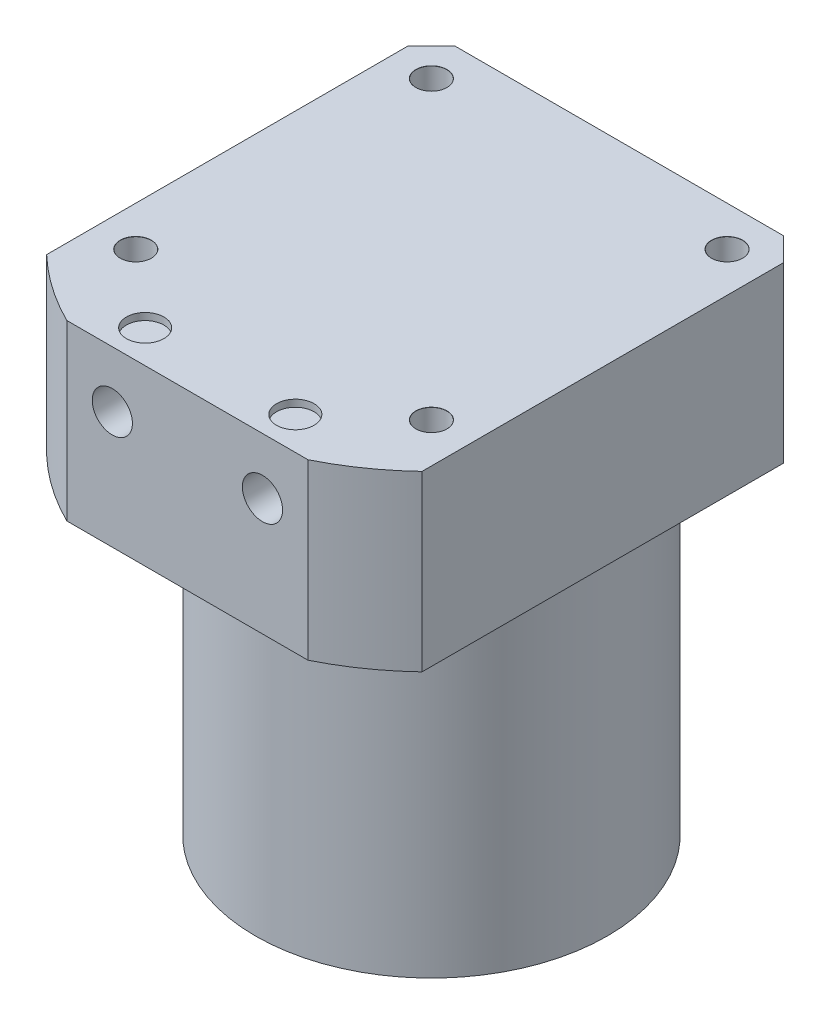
ISO-10303-21;
HEADER;
FILE_DESCRIPTION(('STEP AP214'),'2;1');
FILE_NAME('part.step','',(''),(''),'','','');
FILE_SCHEMA(('AUTOMOTIVE_DESIGN { 1 0 10303 214 1 1 1 1 }'));
ENDSEC;
DATA;
#1=APPLICATION_CONTEXT('core data for automotive mechanical design processes');
#2=APPLICATION_PROTOCOL_DEFINITION('international standard','automotive_design',2000,#1);
#3=PRODUCT_CONTEXT('',#1,'mechanical');
#4=PRODUCT('Part','Part','',(#3));
#5=PRODUCT_RELATED_PRODUCT_CATEGORY('part','',(#4));
#6=PRODUCT_DEFINITION_FORMATION('','',#4);
#7=PRODUCT_DEFINITION_CONTEXT('part definition',#1,'design');
#8=PRODUCT_DEFINITION('design','',#6,#7);
#9=PRODUCT_DEFINITION_SHAPE('','',#8);
#10=(LENGTH_UNIT() NAMED_UNIT(*) SI_UNIT(.MILLI.,.METRE.));
#11=(NAMED_UNIT(*) PLANE_ANGLE_UNIT() SI_UNIT($,.RADIAN.));
#12=(NAMED_UNIT(*) SI_UNIT($,.STERADIAN.) SOLID_ANGLE_UNIT());
#13=UNCERTAINTY_MEASURE_WITH_UNIT(LENGTH_MEASURE(1.E-05),#10,'distance_accuracy_value','');
#14=(GEOMETRIC_REPRESENTATION_CONTEXT(3) GLOBAL_UNCERTAINTY_ASSIGNED_CONTEXT((#13)) GLOBAL_UNIT_ASSIGNED_CONTEXT((#10,
#11,#12)) REPRESENTATION_CONTEXT('',''));
#15=CARTESIAN_POINT('',(0.,0.,0.));
#16=DIRECTION('',(0.,0.,1.));
#17=DIRECTION('',(1.,0.,0.));
#18=AXIS2_PLACEMENT_3D('',#15,#16,#17);
#19=CARTESIAN_POINT('',(-37.5,71.,0.));
#20=DIRECTION('',(0.,-1.,0.));
#21=DIRECTION('',(0.,0.,-1.));
#22=AXIS2_PLACEMENT_3D('',#19,#20,#21);
#23=PLANE('',#22);
#24=CARTESIAN_POINT('',(-31.5,71.,-31.5));
#25=DIRECTION('',(0.,-1.,0.));
#26=DIRECTION('',(0.,0.,-1.));
#27=AXIS2_PLACEMENT_3D('',#24,#25,#26);
#28=CIRCLE('',#27,5.5);
#29=CARTESIAN_POINT('',(-31.5,71.,-37.));
#30=VERTEX_POINT('',#29);
#31=EDGE_CURVE('E336',#30,#30,#28,.T.);
#32=ORIENTED_EDGE('',*,*,#31,.F.);
#33=EDGE_LOOP('',(#32));
#34=FACE_BOUND('',#33,.T.);
#35=CARTESIAN_POINT('',(31.5,71.,-31.5));
#36=DIRECTION('',(0.,-1.,0.));
#37=DIRECTION('',(0.,0.,-1.));
#38=AXIS2_PLACEMENT_3D('',#35,#36,#37);
#39=CIRCLE('',#38,5.5);
#40=CARTESIAN_POINT('',(31.5,71.,-37.));
#41=VERTEX_POINT('',#40);
#42=EDGE_CURVE('E351',#41,#41,#39,.T.);
#43=ORIENTED_EDGE('',*,*,#42,.F.);
#44=EDGE_LOOP('',(#43));
#45=FACE_BOUND('',#44,.T.);
#46=CARTESIAN_POINT('',(31.5,71.,31.5));
#47=DIRECTION('',(0.,-1.,0.));
#48=DIRECTION('',(0.,0.,-1.));
#49=AXIS2_PLACEMENT_3D('',#46,#47,#48);
#50=CIRCLE('',#49,5.5);
#51=CARTESIAN_POINT('',(31.5,71.,26.));
#52=VERTEX_POINT('',#51);
#53=EDGE_CURVE('E366',#52,#52,#50,.T.);
#54=ORIENTED_EDGE('',*,*,#53,.F.);
#55=EDGE_LOOP('',(#54));
#56=FACE_BOUND('',#55,.T.);
#57=CARTESIAN_POINT('',(-31.5,71.,31.5));
#58=DIRECTION('',(0.,-1.,0.));
#59=DIRECTION('',(0.,0.,-1.));
#60=AXIS2_PLACEMENT_3D('',#57,#58,#59);
#61=CIRCLE('',#60,5.5);
#62=CARTESIAN_POINT('',(-31.5,71.,26.));
#63=VERTEX_POINT('',#62);
#64=EDGE_CURVE('E381',#63,#63,#61,.T.);
#65=ORIENTED_EDGE('',*,*,#64,.F.);
#66=EDGE_LOOP('',(#65));
#67=FACE_BOUND('',#66,.T.);
#68=CARTESIAN_POINT('',(0.,71.,0.));
#69=DIRECTION('',(0.,1.,0.));
#70=DIRECTION('',(0.,0.,1.));
#71=AXIS2_PLACEMENT_3D('',#68,#69,#70);
#72=CIRCLE('',#71,37.5);
#73=CARTESIAN_POINT('',(0.,71.,37.5));
#74=VERTEX_POINT('',#73);
#75=EDGE_CURVE('E133',#74,#74,#72,.T.);
#76=ORIENTED_EDGE('',*,*,#75,.T.);
#77=EDGE_LOOP('',(#76));
#78=FACE_BOUND('',#77,.T.);
#79=DIRECTION('',(1.,0.,0.));
#80=VECTOR('',#79,1.);
#81=CARTESIAN_POINT('',(-37.5,71.,-40.));
#82=LINE('',#81,#80);
#83=CARTESIAN_POINT('',(-35.,71.,-40.));
#84=VERTEX_POINT('',#83);
#85=CARTESIAN_POINT('',(35.,71.,-40.));
#86=VERTEX_POINT('',#85);
#87=EDGE_CURVE('E107',#84,#86,#82,.T.);
#88=ORIENTED_EDGE('',*,*,#87,.T.);
#89=DIRECTION('',(-0.70710678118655,0.,-0.707106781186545));
#90=VECTOR('',#89,1.);
#91=CARTESIAN_POINT('',(18.7499999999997,71.,-56.2500000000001));
#92=LINE('',#91,#90);
#93=CARTESIAN_POINT('',(40.,71.,-35.));
#94=VERTEX_POINT('',#93);
#95=EDGE_CURVE('E41',#86,#94,#92,.F.);
#96=ORIENTED_EDGE('',*,*,#95,.T.);
#97=DIRECTION('',(0.,0.,1.));
#98=VECTOR('',#97,1.);
#99=CARTESIAN_POINT('',(40.,71.,0.));
#100=LINE('',#99,#98);
#101=CARTESIAN_POINT('',(40.,71.,42.));
#102=VERTEX_POINT('',#101);
#103=EDGE_CURVE('E122',#94,#102,#100,.T.);
#104=ORIENTED_EDGE('',*,*,#103,.T.);
#105=CARTESIAN_POINT('',(0.,71.,0.));
#106=DIRECTION('',(0.,1.,0.));
#107=DIRECTION('',(0.,0.,1.));
#108=AXIS2_PLACEMENT_3D('',#105,#106,#107);
#109=CIRCLE('',#108,58.);
#110=CARTESIAN_POINT('',(25.6904651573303,71.,52.));
#111=VERTEX_POINT('',#110);
#112=EDGE_CURVE('E130',#111,#102,#109,.T.);
#113=ORIENTED_EDGE('',*,*,#112,.F.);
#114=DIRECTION('',(-1.,0.,0.));
#115=VECTOR('',#114,1.);
#116=CARTESIAN_POINT('',(-37.5,71.,52.));
#117=LINE('',#116,#115);
#118=CARTESIAN_POINT('',(-25.6904651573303,71.,52.));
#119=VERTEX_POINT('',#118);
#120=EDGE_CURVE('E177',#111,#119,#117,.T.);
#121=ORIENTED_EDGE('',*,*,#120,.T.);
#122=CARTESIAN_POINT('',(-40.,71.,42.));
#123=VERTEX_POINT('',#122);
#124=EDGE_CURVE('E125',#123,#119,#109,.T.);
#125=ORIENTED_EDGE('',*,*,#124,.F.);
#126=DIRECTION('',(0.,0.,-1.));
#127=VECTOR('',#126,1.);
#128=CARTESIAN_POINT('',(-40.,71.,0.));
#129=LINE('',#128,#127);
#130=CARTESIAN_POINT('',(-40.,71.,-35.));
#131=VERTEX_POINT('',#130);
#132=EDGE_CURVE('E113',#123,#131,#129,.T.);
#133=ORIENTED_EDGE('',*,*,#132,.T.);
#134=DIRECTION('',(-0.707106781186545,0.,0.70710678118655));
#135=VECTOR('',#134,1.);
#136=CARTESIAN_POINT('',(-56.25,71.,-18.7499999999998));
#137=LINE('',#136,#135);
#138=EDGE_CURVE('E153',#131,#84,#137,.F.);
#139=ORIENTED_EDGE('',*,*,#138,.T.);
#140=EDGE_LOOP('',(#88,#96,#104,#113,#121,#125,#133,#139));
#141=FACE_BOUND('',#140,.T.);
#142=ADVANCED_FACE('F33',(#34,#45,#56,#67,#78,#141),#23,.T.);
#143=CARTESIAN_POINT('',(0.,87.0508296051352,0.));
#144=DIRECTION('',(0.,1.,0.));
#145=DIRECTION('',(0.,0.,1.));
#146=AXIS2_PLACEMENT_3D('',#143,#144,#145);
#147=CYLINDRICAL_SURFACE('',#146,58.);
#148=ORIENTED_EDGE('',*,*,#112,.T.);
#149=DIRECTION('',(0.,1.,0.));
#150=VECTOR('',#149,1.);
#151=CARTESIAN_POINT('',(40.,87.0508296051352,42.));
#152=LINE('',#151,#150);
#153=CARTESIAN_POINT('',(40.,108.,42.));
#154=VERTEX_POINT('',#153);
#155=EDGE_CURVE('E126',#102,#154,#152,.T.);
#156=ORIENTED_EDGE('',*,*,#155,.T.);
#157=CARTESIAN_POINT('',(0.,108.,0.));
#158=DIRECTION('',(0.,1.,0.));
#159=DIRECTION('',(0.,0.,1.));
#160=AXIS2_PLACEMENT_3D('',#157,#158,#159);
#161=CIRCLE('',#160,58.);
#162=CARTESIAN_POINT('',(25.6904651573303,108.,52.));
#163=VERTEX_POINT('',#162);
#164=EDGE_CURVE('E121',#163,#154,#161,.T.);
#165=ORIENTED_EDGE('',*,*,#164,.F.);
#166=DIRECTION('',(0.,1.,0.));
#167=VECTOR('',#166,1.);
#168=CARTESIAN_POINT('',(25.6904651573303,87.0508296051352,52.));
#169=LINE('',#168,#167);
#170=EDGE_CURVE('E180',#163,#111,#169,.F.);
#171=ORIENTED_EDGE('',*,*,#170,.T.);
#172=EDGE_LOOP('',(#148,#156,#165,#171));
#173=FACE_BOUND('',#172,.T.);
#174=ADVANCED_FACE('F184',(#173),#147,.T.);
#175=ORIENTED_EDGE('',*,*,#124,.T.);
#176=DIRECTION('',(0.,1.,0.));
#177=VECTOR('',#176,1.);
#178=CARTESIAN_POINT('',(-25.6904651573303,87.0508296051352,52.));
#179=LINE('',#178,#177);
#180=CARTESIAN_POINT('',(-25.6904651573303,108.,52.));
#181=VERTEX_POINT('',#180);
#182=EDGE_CURVE('E120',#119,#181,#179,.T.);
#183=ORIENTED_EDGE('',*,*,#182,.T.);
#184=CARTESIAN_POINT('',(-40.,108.,42.));
#185=VERTEX_POINT('',#184);
#186=EDGE_CURVE('E104',#185,#181,#161,.T.);
#187=ORIENTED_EDGE('',*,*,#186,.F.);
#188=DIRECTION('',(0.,1.,0.));
#189=VECTOR('',#188,1.);
#190=CARTESIAN_POINT('',(-40.,87.0508296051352,42.));
#191=LINE('',#190,#189);
#192=EDGE_CURVE('E111',#185,#123,#191,.F.);
#193=ORIENTED_EDGE('',*,*,#192,.T.);
#194=EDGE_LOOP('',(#175,#183,#187,#193));
#195=FACE_BOUND('',#194,.T.);
#196=ADVANCED_FACE('F119',(#195),#147,.T.);
#197=CARTESIAN_POINT('',(-58.,108.,0.));
#198=DIRECTION('',(0.,1.,0.));
#199=DIRECTION('',(0.,0.,1.));
#200=AXIS2_PLACEMENT_3D('',#197,#198,#199);
#201=PLANE('',#200);
#202=CARTESIAN_POINT('',(-31.5,108.,-31.5));
#203=DIRECTION('',(0.,-1.,0.));
#204=DIRECTION('',(0.,0.,-1.));
#205=AXIS2_PLACEMENT_3D('',#202,#203,#204);
#206=CIRCLE('',#205,3.32499999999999);
#207=CARTESIAN_POINT('',(-31.5,108.,-34.825));
#208=VERTEX_POINT('',#207);
#209=EDGE_CURVE('E337',#208,#208,#206,.T.);
#210=ORIENTED_EDGE('',*,*,#209,.T.);
#211=EDGE_LOOP('',(#210));
#212=FACE_BOUND('',#211,.T.);
#213=CARTESIAN_POINT('',(31.5,108.,-31.5));
#214=DIRECTION('',(0.,-1.,0.));
#215=DIRECTION('',(0.,0.,-1.));
#216=AXIS2_PLACEMENT_3D('',#213,#214,#215);
#217=CIRCLE('',#216,3.32499999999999);
#218=CARTESIAN_POINT('',(31.5,108.,-34.825));
#219=VERTEX_POINT('',#218);
#220=EDGE_CURVE('E348',#219,#219,#217,.T.);
#221=ORIENTED_EDGE('',*,*,#220,.T.);
#222=EDGE_LOOP('',(#221));
#223=FACE_BOUND('',#222,.T.);
#224=CARTESIAN_POINT('',(31.5,108.,31.5));
#225=DIRECTION('',(0.,-1.,0.));
#226=DIRECTION('',(0.,0.,-1.));
#227=AXIS2_PLACEMENT_3D('',#224,#225,#226);
#228=CIRCLE('',#227,3.32499999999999);
#229=CARTESIAN_POINT('',(31.5,108.,28.175));
#230=VERTEX_POINT('',#229);
#231=EDGE_CURVE('E363',#230,#230,#228,.T.);
#232=ORIENTED_EDGE('',*,*,#231,.T.);
#233=EDGE_LOOP('',(#232));
#234=FACE_BOUND('',#233,.T.);
#235=CARTESIAN_POINT('',(-31.5,108.,31.5));
#236=DIRECTION('',(0.,-1.,0.));
#237=DIRECTION('',(0.,0.,-1.));
#238=AXIS2_PLACEMENT_3D('',#235,#236,#237);
#239=CIRCLE('',#238,3.32499999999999);
#240=CARTESIAN_POINT('',(-31.5,108.,28.175));
#241=VERTEX_POINT('',#240);
#242=EDGE_CURVE('E378',#241,#241,#239,.T.);
#243=ORIENTED_EDGE('',*,*,#242,.T.);
#244=EDGE_LOOP('',(#243));
#245=FACE_BOUND('',#244,.T.);
#246=CARTESIAN_POINT('',(-16.,108.,45.));
#247=DIRECTION('',(0.,1.,0.));
#248=DIRECTION('',(0.,0.,1.));
#249=AXIS2_PLACEMENT_3D('',#246,#247,#248);
#250=CIRCLE('',#249,4.);
#251=CARTESIAN_POINT('',(-16.,108.,49.));
#252=VERTEX_POINT('',#251);
#253=EDGE_CURVE('E405',#252,#252,#250,.T.);
#254=ORIENTED_EDGE('',*,*,#253,.F.);
#255=EDGE_LOOP('',(#254));
#256=FACE_BOUND('',#255,.T.);
#257=CARTESIAN_POINT('',(16.,108.,45.));
#258=DIRECTION('',(0.,1.,0.));
#259=DIRECTION('',(0.,0.,1.));
#260=AXIS2_PLACEMENT_3D('',#257,#258,#259);
#261=CIRCLE('',#260,4.);
#262=CARTESIAN_POINT('',(16.,108.,49.));
#263=VERTEX_POINT('',#262);
#264=EDGE_CURVE('E170',#263,#263,#261,.T.);
#265=ORIENTED_EDGE('',*,*,#264,.F.);
#266=EDGE_LOOP('',(#265));
#267=FACE_BOUND('',#266,.T.);
#268=DIRECTION('',(0.,0.,-1.));
#269=VECTOR('',#268,1.);
#270=CARTESIAN_POINT('',(40.,108.,0.));
#271=LINE('',#270,#269);
#272=CARTESIAN_POINT('',(40.,108.,-35.));
#273=VERTEX_POINT('',#272);
#274=EDGE_CURVE('E139',#154,#273,#271,.T.);
#275=ORIENTED_EDGE('',*,*,#274,.T.);
#276=DIRECTION('',(0.70710678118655,0.,0.707106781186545));
#277=VECTOR('',#276,1.);
#278=CARTESIAN_POINT('',(8.4999999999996,108.,-66.5000000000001));
#279=LINE('',#278,#277);
#280=CARTESIAN_POINT('',(35.,108.,-40.));
#281=VERTEX_POINT('',#280);
#282=EDGE_CURVE('E147',#273,#281,#279,.F.);
#283=ORIENTED_EDGE('',*,*,#282,.T.);
#284=DIRECTION('',(-1.,0.,0.));
#285=VECTOR('',#284,1.);
#286=CARTESIAN_POINT('',(-40.,108.,-40.));
#287=LINE('',#286,#285);
#288=CARTESIAN_POINT('',(-35.,108.,-40.));
#289=VERTEX_POINT('',#288);
#290=EDGE_CURVE('E108',#281,#289,#287,.T.);
#291=ORIENTED_EDGE('',*,*,#290,.T.);
#292=DIRECTION('',(0.707106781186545,0.,-0.70710678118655));
#293=VECTOR('',#292,1.);
#294=CARTESIAN_POINT('',(-66.4999999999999,108.,-8.49999999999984));
#295=LINE('',#294,#293);
#296=CARTESIAN_POINT('',(-40.,108.,-35.));
#297=VERTEX_POINT('',#296);
#298=EDGE_CURVE('E106',#289,#297,#295,.F.);
#299=ORIENTED_EDGE('',*,*,#298,.T.);
#300=DIRECTION('',(0.,0.,1.));
#301=VECTOR('',#300,1.);
#302=CARTESIAN_POINT('',(-40.,108.,-40.));
#303=LINE('',#302,#301);
#304=EDGE_CURVE('E98',#297,#185,#303,.T.);
#305=ORIENTED_EDGE('',*,*,#304,.T.);
#306=ORIENTED_EDGE('',*,*,#186,.T.);
#307=DIRECTION('',(1.,0.,0.));
#308=VECTOR('',#307,1.);
#309=CARTESIAN_POINT('',(-58.,108.,52.));
#310=LINE('',#309,#308);
#311=EDGE_CURVE('E141',#181,#163,#310,.T.);
#312=ORIENTED_EDGE('',*,*,#311,.T.);
#313=ORIENTED_EDGE('',*,*,#164,.T.);
#314=EDGE_LOOP('',(#275,#283,#291,#299,#305,#306,#312,#313));
#315=FACE_BOUND('',#314,.T.);
#316=ADVANCED_FACE('F101',(#212,#223,#234,#245,#256,#267,#315),#201,.T.);
#317=CARTESIAN_POINT('',(0.,0.,0.));
#318=DIRECTION('',(0.,-1.,0.));
#319=DIRECTION('',(0.,0.,-1.));
#320=AXIS2_PLACEMENT_3D('',#317,#318,#319);
#321=PLANE('',#320);
#322=CARTESIAN_POINT('',(0.,0.,0.));
#323=DIRECTION('',(0.,1.,0.));
#324=DIRECTION('',(0.,0.,1.));
#325=AXIS2_PLACEMENT_3D('',#322,#323,#324);
#326=CIRCLE('',#325,37.5);
#327=CARTESIAN_POINT('',(0.,0.,37.5));
#328=VERTEX_POINT('',#327);
#329=EDGE_CURVE('E136',#328,#328,#326,.T.);
#330=ORIENTED_EDGE('',*,*,#329,.F.);
#331=EDGE_LOOP('',(#330));
#332=FACE_BOUND('',#331,.T.);
#333=ADVANCED_FACE('F212',(#332),#321,.T.);
#334=CARTESIAN_POINT('',(0.,87.0508296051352,0.));
#335=DIRECTION('',(0.,1.,0.));
#336=DIRECTION('',(0.,0.,1.));
#337=AXIS2_PLACEMENT_3D('',#334,#335,#336);
#338=CYLINDRICAL_SURFACE('',#337,37.5);
#339=ORIENTED_EDGE('',*,*,#329,.T.);
#340=EDGE_LOOP('',(#339));
#341=FACE_BOUND('',#340,.T.);
#342=ORIENTED_EDGE('',*,*,#75,.F.);
#343=EDGE_LOOP('',(#342));
#344=FACE_BOUND('',#343,.T.);
#345=ADVANCED_FACE('F209',(#341,#344),#338,.T.);
#346=CARTESIAN_POINT('',(-40.,0.,-40.));
#347=DIRECTION('',(0.,0.,-1.));
#348=DIRECTION('',(-1.,0.,0.));
#349=AXIS2_PLACEMENT_3D('',#346,#347,#348);
#350=PLANE('',#349);
#351=ORIENTED_EDGE('',*,*,#290,.F.);
#352=DIRECTION('',(0.,-1.,0.));
#353=VECTOR('',#352,1.);
#354=CARTESIAN_POINT('',(35.,0.,-40.));
#355=LINE('',#354,#353);
#356=EDGE_CURVE('E54',#281,#86,#355,.T.);
#357=ORIENTED_EDGE('',*,*,#356,.T.);
#358=ORIENTED_EDGE('',*,*,#87,.F.);
#359=DIRECTION('',(0.,1.,0.));
#360=VECTOR('',#359,1.);
#361=CARTESIAN_POINT('',(-35.,0.,-40.));
#362=LINE('',#361,#360);
#363=EDGE_CURVE('E149',#84,#289,#362,.T.);
#364=ORIENTED_EDGE('',*,*,#363,.T.);
#365=EDGE_LOOP('',(#351,#357,#358,#364));
#366=FACE_BOUND('',#365,.T.);
#367=ADVANCED_FACE('F165',(#366),#350,.T.);
#368=CARTESIAN_POINT('',(-40.,0.,-40.));
#369=DIRECTION('',(-1.,0.,0.));
#370=DIRECTION('',(0.,0.,1.));
#371=AXIS2_PLACEMENT_3D('',#368,#369,#370);
#372=PLANE('',#371);
#373=ORIENTED_EDGE('',*,*,#304,.F.);
#374=DIRECTION('',(0.,-1.,0.));
#375=VECTOR('',#374,1.);
#376=CARTESIAN_POINT('',(-40.,0.,-35.));
#377=LINE('',#376,#375);
#378=EDGE_CURVE('E12',#297,#131,#377,.T.);
#379=ORIENTED_EDGE('',*,*,#378,.T.);
#380=ORIENTED_EDGE('',*,*,#132,.F.);
#381=ORIENTED_EDGE('',*,*,#192,.F.);
#382=EDGE_LOOP('',(#373,#379,#380,#381));
#383=FACE_BOUND('',#382,.T.);
#384=ADVANCED_FACE('F112',(#383),#372,.T.);
#385=CARTESIAN_POINT('',(40.,0.,-40.));
#386=DIRECTION('',(1.,0.,0.));
#387=DIRECTION('',(0.,0.,-1.));
#388=AXIS2_PLACEMENT_3D('',#385,#386,#387);
#389=PLANE('',#388);
#390=ORIENTED_EDGE('',*,*,#103,.F.);
#391=DIRECTION('',(0.,1.,0.));
#392=VECTOR('',#391,1.);
#393=CARTESIAN_POINT('',(40.,0.,-35.));
#394=LINE('',#393,#392);
#395=EDGE_CURVE('E143',#94,#273,#394,.T.);
#396=ORIENTED_EDGE('',*,*,#395,.T.);
#397=ORIENTED_EDGE('',*,*,#274,.F.);
#398=ORIENTED_EDGE('',*,*,#155,.F.);
#399=EDGE_LOOP('',(#390,#396,#397,#398));
#400=FACE_BOUND('',#399,.T.);
#401=ADVANCED_FACE('F162',(#400),#389,.T.);
#402=CARTESIAN_POINT('',(-40.,0.,52.));
#403=DIRECTION('',(0.,0.,1.));
#404=DIRECTION('',(1.,0.,0.));
#405=AXIS2_PLACEMENT_3D('',#402,#403,#404);
#406=PLANE('',#405);
#407=CARTESIAN_POINT('',(-16.,96.,52.));
#408=DIRECTION('',(0.,0.,1.));
#409=DIRECTION('',(1.,0.,0.));
#410=AXIS2_PLACEMENT_3D('',#407,#408,#409);
#411=CIRCLE('',#410,4.283);
#412=CARTESIAN_POINT('',(-11.717,96.,52.));
#413=VERTEX_POINT('',#412);
#414=EDGE_CURVE('E393',#413,#413,#411,.T.);
#415=ORIENTED_EDGE('',*,*,#414,.F.);
#416=EDGE_LOOP('',(#415));
#417=FACE_BOUND('',#416,.T.);
#418=CARTESIAN_POINT('',(16.,96.,52.));
#419=DIRECTION('',(0.,0.,1.));
#420=DIRECTION('',(1.,0.,0.));
#421=AXIS2_PLACEMENT_3D('',#418,#419,#420);
#422=CIRCLE('',#421,4.283);
#423=CARTESIAN_POINT('',(20.283,96.,52.));
#424=VERTEX_POINT('',#423);
#425=EDGE_CURVE('E399',#424,#424,#422,.T.);
#426=ORIENTED_EDGE('',*,*,#425,.F.);
#427=EDGE_LOOP('',(#426));
#428=FACE_BOUND('',#427,.T.);
#429=ORIENTED_EDGE('',*,*,#311,.F.);
#430=ORIENTED_EDGE('',*,*,#182,.F.);
#431=ORIENTED_EDGE('',*,*,#120,.F.);
#432=ORIENTED_EDGE('',*,*,#170,.F.);
#433=EDGE_LOOP('',(#429,#430,#431,#432));
#434=FACE_BOUND('',#433,.T.);
#435=ADVANCED_FACE('F186',(#417,#428,#434),#406,.T.);
#436=CARTESIAN_POINT('',(40.,0.,-35.));
#437=DIRECTION('',(-0.707106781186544,0.,0.70710678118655));
#438=DIRECTION('',(0.70710678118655,0.,0.707106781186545));
#439=AXIS2_PLACEMENT_3D('',#436,#437,#438);
#440=PLANE('',#439);
#441=ORIENTED_EDGE('',*,*,#95,.F.);
#442=ORIENTED_EDGE('',*,*,#356,.F.);
#443=ORIENTED_EDGE('',*,*,#282,.F.);
#444=ORIENTED_EDGE('',*,*,#395,.F.);
#445=EDGE_LOOP('',(#441,#442,#443,#444));
#446=FACE_BOUND('',#445,.T.);
#447=ADVANCED_FACE('F164',(#446),#440,.F.);
#448=CARTESIAN_POINT('',(-35.,0.,-40.));
#449=DIRECTION('',(0.70710678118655,0.,0.707106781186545));
#450=DIRECTION('',(0.707106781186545,0.,-0.70710678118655));
#451=AXIS2_PLACEMENT_3D('',#448,#449,#450);
#452=PLANE('',#451);
#453=ORIENTED_EDGE('',*,*,#138,.F.);
#454=ORIENTED_EDGE('',*,*,#378,.F.);
#455=ORIENTED_EDGE('',*,*,#298,.F.);
#456=ORIENTED_EDGE('',*,*,#363,.F.);
#457=EDGE_LOOP('',(#453,#454,#455,#456));
#458=FACE_BOUND('',#457,.T.);
#459=ADVANCED_FACE('F35',(#458),#452,.F.);
#460=CARTESIAN_POINT('',(16.,106.5,45.));
#461=DIRECTION('',(0.,-1.,0.));
#462=DIRECTION('',(0.,0.,-1.));
#463=AXIS2_PLACEMENT_3D('',#460,#461,#462);
#464=PLANE('',#463);
#465=CARTESIAN_POINT('',(16.,106.5,45.));
#466=DIRECTION('',(0.,1.,0.));
#467=DIRECTION('',(0.,0.,1.));
#468=AXIS2_PLACEMENT_3D('',#465,#466,#467);
#469=CIRCLE('',#468,4.);
#470=CARTESIAN_POINT('',(16.,106.5,49.));
#471=VERTEX_POINT('',#470);
#472=EDGE_CURVE('E167',#471,#471,#469,.T.);
#473=ORIENTED_EDGE('',*,*,#472,.T.);
#474=EDGE_LOOP('',(#473));
#475=FACE_BOUND('',#474,.T.);
#476=ADVANCED_FACE('F190',(#475),#464,.F.);
#477=CARTESIAN_POINT('',(16.,108.,45.));
#478=DIRECTION('',(0.,1.,0.));
#479=DIRECTION('',(0.,0.,1.));
#480=AXIS2_PLACEMENT_3D('',#477,#478,#479);
#481=CYLINDRICAL_SURFACE('',#480,4.);
#482=ORIENTED_EDGE('',*,*,#472,.F.);
#483=EDGE_LOOP('',(#482));
#484=FACE_BOUND('',#483,.T.);
#485=ORIENTED_EDGE('',*,*,#264,.T.);
#486=EDGE_LOOP('',(#485));
#487=FACE_BOUND('',#486,.T.);
#488=ADVANCED_FACE('F195',(#484,#487),#481,.F.);
#489=CARTESIAN_POINT('',(-16.,106.5,45.));
#490=DIRECTION('',(0.,-1.,0.));
#491=DIRECTION('',(0.,0.,-1.));
#492=AXIS2_PLACEMENT_3D('',#489,#490,#491);
#493=PLANE('',#492);
#494=CARTESIAN_POINT('',(-16.,106.5,45.));
#495=DIRECTION('',(0.,1.,0.));
#496=DIRECTION('',(0.,0.,1.));
#497=AXIS2_PLACEMENT_3D('',#494,#495,#496);
#498=CIRCLE('',#497,4.);
#499=CARTESIAN_POINT('',(-16.,106.5,49.));
#500=VERTEX_POINT('',#499);
#501=EDGE_CURVE('E408',#500,#500,#498,.T.);
#502=ORIENTED_EDGE('',*,*,#501,.T.);
#503=EDGE_LOOP('',(#502));
#504=FACE_BOUND('',#503,.T.);
#505=ADVANCED_FACE('F241',(#504),#493,.F.);
#506=CARTESIAN_POINT('',(-16.,108.,45.));
#507=DIRECTION('',(0.,1.,0.));
#508=DIRECTION('',(0.,0.,1.));
#509=AXIS2_PLACEMENT_3D('',#506,#507,#508);
#510=CYLINDRICAL_SURFACE('',#509,4.);
#511=ORIENTED_EDGE('',*,*,#501,.F.);
#512=EDGE_LOOP('',(#511));
#513=FACE_BOUND('',#512,.T.);
#514=ORIENTED_EDGE('',*,*,#253,.T.);
#515=EDGE_LOOP('',(#514));
#516=FACE_BOUND('',#515,.T.);
#517=ADVANCED_FACE('F245',(#513,#516),#510,.F.);
#518=CARTESIAN_POINT('',(16.,96.,29.82));
#519=DIRECTION('',(0.,0.,-1.));
#520=DIRECTION('',(-1.,0.,0.));
#521=AXIS2_PLACEMENT_3D('',#518,#519,#520);
#522=PLANE('',#521);
#523=CARTESIAN_POINT('',(16.,96.,29.82));
#524=DIRECTION('',(0.,0.,1.));
#525=DIRECTION('',(1.,0.,0.));
#526=AXIS2_PLACEMENT_3D('',#523,#524,#525);
#527=CIRCLE('',#526,4.283);
#528=CARTESIAN_POINT('',(20.283,96.,29.82));
#529=VERTEX_POINT('',#528);
#530=EDGE_CURVE('E402',#529,#529,#527,.T.);
#531=ORIENTED_EDGE('',*,*,#530,.T.);
#532=EDGE_LOOP('',(#531));
#533=FACE_BOUND('',#532,.T.);
#534=ADVANCED_FACE('F249',(#533),#522,.F.);
#535=CARTESIAN_POINT('',(16.,96.,52.));
#536=DIRECTION('',(0.,0.,1.));
#537=DIRECTION('',(1.,0.,0.));
#538=AXIS2_PLACEMENT_3D('',#535,#536,#537);
#539=CYLINDRICAL_SURFACE('',#538,4.283);
#540=ORIENTED_EDGE('',*,*,#530,.F.);
#541=EDGE_LOOP('',(#540));
#542=FACE_BOUND('',#541,.T.);
#543=ORIENTED_EDGE('',*,*,#425,.T.);
#544=EDGE_LOOP('',(#543));
#545=FACE_BOUND('',#544,.T.);
#546=ADVANCED_FACE('F253',(#542,#545),#539,.F.);
#547=CARTESIAN_POINT('',(-16.,96.,29.82));
#548=DIRECTION('',(0.,0.,-1.));
#549=DIRECTION('',(-1.,0.,0.));
#550=AXIS2_PLACEMENT_3D('',#547,#548,#549);
#551=PLANE('',#550);
#552=CARTESIAN_POINT('',(-16.,96.,29.82));
#553=DIRECTION('',(0.,0.,1.));
#554=DIRECTION('',(1.,0.,0.));
#555=AXIS2_PLACEMENT_3D('',#552,#553,#554);
#556=CIRCLE('',#555,4.283);
#557=CARTESIAN_POINT('',(-11.717,96.,29.82));
#558=VERTEX_POINT('',#557);
#559=EDGE_CURVE('E396',#558,#558,#556,.T.);
#560=ORIENTED_EDGE('',*,*,#559,.T.);
#561=EDGE_LOOP('',(#560));
#562=FACE_BOUND('',#561,.T.);
#563=ADVANCED_FACE('F257',(#562),#551,.F.);
#564=CARTESIAN_POINT('',(-16.,96.,52.));
#565=DIRECTION('',(0.,0.,1.));
#566=DIRECTION('',(1.,0.,0.));
#567=AXIS2_PLACEMENT_3D('',#564,#565,#566);
#568=CYLINDRICAL_SURFACE('',#567,4.283);
#569=ORIENTED_EDGE('',*,*,#559,.F.);
#570=EDGE_LOOP('',(#569));
#571=FACE_BOUND('',#570,.T.);
#572=ORIENTED_EDGE('',*,*,#414,.T.);
#573=EDGE_LOOP('',(#572));
#574=FACE_BOUND('',#573,.T.);
#575=ADVANCED_FACE('F261',(#571,#574),#568,.F.);
#576=CARTESIAN_POINT('',(-31.5,107.975,31.5));
#577=DIRECTION('',(0.,1.,0.));
#578=DIRECTION('',(0.,0.,1.));
#579=AXIS2_PLACEMENT_3D('',#576,#577,#578);
#580=CONICAL_SURFACE('',#579,3.29999999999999,0.785398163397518);
#581=ORIENTED_EDGE('',*,*,#242,.F.);
#582=EDGE_LOOP('',(#581));
#583=FACE_BOUND('',#582,.T.);
#584=CARTESIAN_POINT('',(-31.5,107.975,31.5));
#585=DIRECTION('',(0.,-1.,0.));
#586=DIRECTION('',(0.,0.,-1.));
#587=AXIS2_PLACEMENT_3D('',#584,#585,#586);
#588=CIRCLE('',#587,3.29999999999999);
#589=CARTESIAN_POINT('',(-31.5,107.975,28.2));
#590=VERTEX_POINT('',#589);
#591=EDGE_CURVE('E390',#590,#590,#588,.T.);
#592=ORIENTED_EDGE('',*,*,#591,.T.);
#593=EDGE_LOOP('',(#592));
#594=FACE_BOUND('',#593,.T.);
#595=ADVANCED_FACE('F265',(#583,#594),#580,.F.);
#596=CARTESIAN_POINT('',(-31.5,71.,31.5));
#597=DIRECTION('',(0.,-1.,0.));
#598=DIRECTION('',(0.,0.,-1.));
#599=AXIS2_PLACEMENT_3D('',#596,#597,#598);
#600=CYLINDRICAL_SURFACE('',#599,3.3);
#601=ORIENTED_EDGE('',*,*,#591,.F.);
#602=EDGE_LOOP('',(#601));
#603=FACE_BOUND('',#602,.T.);
#604=CARTESIAN_POINT('',(-31.5,77.,31.5));
#605=DIRECTION('',(0.,-1.,0.));
#606=DIRECTION('',(0.,0.,-1.));
#607=AXIS2_PLACEMENT_3D('',#604,#605,#606);
#608=CIRCLE('',#607,3.3);
#609=CARTESIAN_POINT('',(-31.5,77.,28.2));
#610=VERTEX_POINT('',#609);
#611=EDGE_CURVE('E387',#610,#610,#608,.T.);
#612=ORIENTED_EDGE('',*,*,#611,.T.);
#613=EDGE_LOOP('',(#612));
#614=FACE_BOUND('',#613,.T.);
#615=ADVANCED_FACE('F269',(#603,#614),#600,.F.);
#616=CARTESIAN_POINT('',(-28.2,77.,31.5));
#617=DIRECTION('',(0.,1.,0.));
#618=DIRECTION('',(0.,0.,1.));
#619=AXIS2_PLACEMENT_3D('',#616,#617,#618);
#620=PLANE('',#619);
#621=ORIENTED_EDGE('',*,*,#611,.F.);
#622=EDGE_LOOP('',(#621));
#623=FACE_BOUND('',#622,.T.);
#624=CARTESIAN_POINT('',(-31.5,77.,31.5));
#625=DIRECTION('',(0.,-1.,0.));
#626=DIRECTION('',(0.,0.,-1.));
#627=AXIS2_PLACEMENT_3D('',#624,#625,#626);
#628=CIRCLE('',#627,5.5);
#629=CARTESIAN_POINT('',(-31.5,77.,26.));
#630=VERTEX_POINT('',#629);
#631=EDGE_CURVE('E384',#630,#630,#628,.T.);
#632=ORIENTED_EDGE('',*,*,#631,.T.);
#633=EDGE_LOOP('',(#632));
#634=FACE_BOUND('',#633,.T.);
#635=ADVANCED_FACE('F273',(#623,#634),#620,.F.);
#636=CARTESIAN_POINT('',(-31.5,71.,31.5));
#637=DIRECTION('',(0.,-1.,0.));
#638=DIRECTION('',(0.,0.,-1.));
#639=AXIS2_PLACEMENT_3D('',#636,#637,#638);
#640=CYLINDRICAL_SURFACE('',#639,5.5);
#641=ORIENTED_EDGE('',*,*,#631,.F.);
#642=EDGE_LOOP('',(#641));
#643=FACE_BOUND('',#642,.T.);
#644=ORIENTED_EDGE('',*,*,#64,.T.);
#645=EDGE_LOOP('',(#644));
#646=FACE_BOUND('',#645,.T.);
#647=ADVANCED_FACE('F277',(#643,#646),#640,.F.);
#648=CARTESIAN_POINT('',(31.5,107.975,31.5));
#649=DIRECTION('',(0.,1.,0.));
#650=DIRECTION('',(0.,0.,1.));
#651=AXIS2_PLACEMENT_3D('',#648,#649,#650);
#652=CONICAL_SURFACE('',#651,3.29999999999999,0.785398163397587);
#653=ORIENTED_EDGE('',*,*,#231,.F.);
#654=EDGE_LOOP('',(#653));
#655=FACE_BOUND('',#654,.T.);
#656=CARTESIAN_POINT('',(31.5,107.975,31.5));
#657=DIRECTION('',(0.,-1.,0.));
#658=DIRECTION('',(0.,0.,-1.));
#659=AXIS2_PLACEMENT_3D('',#656,#657,#658);
#660=CIRCLE('',#659,3.29999999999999);
#661=CARTESIAN_POINT('',(31.5,107.975,28.2));
#662=VERTEX_POINT('',#661);
#663=EDGE_CURVE('E375',#662,#662,#660,.T.);
#664=ORIENTED_EDGE('',*,*,#663,.T.);
#665=EDGE_LOOP('',(#664));
#666=FACE_BOUND('',#665,.T.);
#667=ADVANCED_FACE('F281',(#655,#666),#652,.F.);
#668=CARTESIAN_POINT('',(31.5,71.,31.5));
#669=DIRECTION('',(0.,-1.,0.));
#670=DIRECTION('',(0.,0.,-1.));
#671=AXIS2_PLACEMENT_3D('',#668,#669,#670);
#672=CYLINDRICAL_SURFACE('',#671,3.3);
#673=ORIENTED_EDGE('',*,*,#663,.F.);
#674=EDGE_LOOP('',(#673));
#675=FACE_BOUND('',#674,.T.);
#676=CARTESIAN_POINT('',(31.5,77.,31.5));
#677=DIRECTION('',(0.,-1.,0.));
#678=DIRECTION('',(0.,0.,-1.));
#679=AXIS2_PLACEMENT_3D('',#676,#677,#678);
#680=CIRCLE('',#679,3.3);
#681=CARTESIAN_POINT('',(31.5,77.,28.2));
#682=VERTEX_POINT('',#681);
#683=EDGE_CURVE('E372',#682,#682,#680,.T.);
#684=ORIENTED_EDGE('',*,*,#683,.T.);
#685=EDGE_LOOP('',(#684));
#686=FACE_BOUND('',#685,.T.);
#687=ADVANCED_FACE('F285',(#675,#686),#672,.F.);
#688=CARTESIAN_POINT('',(34.8,77.,31.5));
#689=DIRECTION('',(0.,1.,0.));
#690=DIRECTION('',(0.,0.,1.));
#691=AXIS2_PLACEMENT_3D('',#688,#689,#690);
#692=PLANE('',#691);
#693=ORIENTED_EDGE('',*,*,#683,.F.);
#694=EDGE_LOOP('',(#693));
#695=FACE_BOUND('',#694,.T.);
#696=CARTESIAN_POINT('',(31.5,77.,31.5));
#697=DIRECTION('',(0.,-1.,0.));
#698=DIRECTION('',(0.,0.,-1.));
#699=AXIS2_PLACEMENT_3D('',#696,#697,#698);
#700=CIRCLE('',#699,5.5);
#701=CARTESIAN_POINT('',(31.5,77.,26.));
#702=VERTEX_POINT('',#701);
#703=EDGE_CURVE('E369',#702,#702,#700,.T.);
#704=ORIENTED_EDGE('',*,*,#703,.T.);
#705=EDGE_LOOP('',(#704));
#706=FACE_BOUND('',#705,.T.);
#707=ADVANCED_FACE('F289',(#695,#706),#692,.F.);
#708=CARTESIAN_POINT('',(31.5,71.,31.5));
#709=DIRECTION('',(0.,-1.,0.));
#710=DIRECTION('',(0.,0.,-1.));
#711=AXIS2_PLACEMENT_3D('',#708,#709,#710);
#712=CYLINDRICAL_SURFACE('',#711,5.5);
#713=ORIENTED_EDGE('',*,*,#703,.F.);
#714=EDGE_LOOP('',(#713));
#715=FACE_BOUND('',#714,.T.);
#716=ORIENTED_EDGE('',*,*,#53,.T.);
#717=EDGE_LOOP('',(#716));
#718=FACE_BOUND('',#717,.T.);
#719=ADVANCED_FACE('F293',(#715,#718),#712,.F.);
#720=CARTESIAN_POINT('',(31.5,107.975,-31.5));
#721=DIRECTION('',(0.,1.,0.));
#722=DIRECTION('',(0.,0.,1.));
#723=AXIS2_PLACEMENT_3D('',#720,#721,#722);
#724=CONICAL_SURFACE('',#723,3.29999999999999,0.785398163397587);
#725=ORIENTED_EDGE('',*,*,#220,.F.);
#726=EDGE_LOOP('',(#725));
#727=FACE_BOUND('',#726,.T.);
#728=CARTESIAN_POINT('',(31.5,107.975,-31.5));
#729=DIRECTION('',(0.,-1.,0.));
#730=DIRECTION('',(0.,0.,-1.));
#731=AXIS2_PLACEMENT_3D('',#728,#729,#730);
#732=CIRCLE('',#731,3.29999999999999);
#733=CARTESIAN_POINT('',(31.5,107.975,-34.8));
#734=VERTEX_POINT('',#733);
#735=EDGE_CURVE('E360',#734,#734,#732,.T.);
#736=ORIENTED_EDGE('',*,*,#735,.T.);
#737=EDGE_LOOP('',(#736));
#738=FACE_BOUND('',#737,.T.);
#739=ADVANCED_FACE('F297',(#727,#738),#724,.F.);
#740=CARTESIAN_POINT('',(31.5,71.,-31.5));
#741=DIRECTION('',(0.,-1.,0.));
#742=DIRECTION('',(0.,0.,-1.));
#743=AXIS2_PLACEMENT_3D('',#740,#741,#742);
#744=CYLINDRICAL_SURFACE('',#743,3.3);
#745=ORIENTED_EDGE('',*,*,#735,.F.);
#746=EDGE_LOOP('',(#745));
#747=FACE_BOUND('',#746,.T.);
#748=CARTESIAN_POINT('',(31.5,77.,-31.5));
#749=DIRECTION('',(0.,-1.,0.));
#750=DIRECTION('',(0.,0.,-1.));
#751=AXIS2_PLACEMENT_3D('',#748,#749,#750);
#752=CIRCLE('',#751,3.3);
#753=CARTESIAN_POINT('',(31.5,77.,-34.8));
#754=VERTEX_POINT('',#753);
#755=EDGE_CURVE('E357',#754,#754,#752,.T.);
#756=ORIENTED_EDGE('',*,*,#755,.T.);
#757=EDGE_LOOP('',(#756));
#758=FACE_BOUND('',#757,.T.);
#759=ADVANCED_FACE('F301',(#747,#758),#744,.F.);
#760=CARTESIAN_POINT('',(34.8,77.,-31.5));
#761=DIRECTION('',(0.,1.,0.));
#762=DIRECTION('',(0.,0.,1.));
#763=AXIS2_PLACEMENT_3D('',#760,#761,#762);
#764=PLANE('',#763);
#765=ORIENTED_EDGE('',*,*,#755,.F.);
#766=EDGE_LOOP('',(#765));
#767=FACE_BOUND('',#766,.T.);
#768=CARTESIAN_POINT('',(31.5,77.,-31.5));
#769=DIRECTION('',(0.,-1.,0.));
#770=DIRECTION('',(0.,0.,-1.));
#771=AXIS2_PLACEMENT_3D('',#768,#769,#770);
#772=CIRCLE('',#771,5.5);
#773=CARTESIAN_POINT('',(31.5,77.,-37.));
#774=VERTEX_POINT('',#773);
#775=EDGE_CURVE('E354',#774,#774,#772,.T.);
#776=ORIENTED_EDGE('',*,*,#775,.T.);
#777=EDGE_LOOP('',(#776));
#778=FACE_BOUND('',#777,.T.);
#779=ADVANCED_FACE('F305',(#767,#778),#764,.F.);
#780=CARTESIAN_POINT('',(31.5,71.,-31.5));
#781=DIRECTION('',(0.,-1.,0.));
#782=DIRECTION('',(0.,0.,-1.));
#783=AXIS2_PLACEMENT_3D('',#780,#781,#782);
#784=CYLINDRICAL_SURFACE('',#783,5.5);
#785=ORIENTED_EDGE('',*,*,#775,.F.);
#786=EDGE_LOOP('',(#785));
#787=FACE_BOUND('',#786,.T.);
#788=ORIENTED_EDGE('',*,*,#42,.T.);
#789=EDGE_LOOP('',(#788));
#790=FACE_BOUND('',#789,.T.);
#791=ADVANCED_FACE('F309',(#787,#790),#784,.F.);
#792=CARTESIAN_POINT('',(-31.5,107.975,-31.5));
#793=DIRECTION('',(0.,1.,0.));
#794=DIRECTION('',(0.,0.,1.));
#795=AXIS2_PLACEMENT_3D('',#792,#793,#794);
#796=CONICAL_SURFACE('',#795,3.29999999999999,0.785398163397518);
#797=ORIENTED_EDGE('',*,*,#209,.F.);
#798=EDGE_LOOP('',(#797));
#799=FACE_BOUND('',#798,.T.);
#800=CARTESIAN_POINT('',(-31.5,107.975,-31.5));
#801=DIRECTION('',(0.,-1.,0.));
#802=DIRECTION('',(0.,0.,-1.));
#803=AXIS2_PLACEMENT_3D('',#800,#801,#802);
#804=CIRCLE('',#803,3.29999999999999);
#805=CARTESIAN_POINT('',(-31.5,107.975,-34.8));
#806=VERTEX_POINT('',#805);
#807=EDGE_CURVE('E345',#806,#806,#804,.T.);
#808=ORIENTED_EDGE('',*,*,#807,.T.);
#809=EDGE_LOOP('',(#808));
#810=FACE_BOUND('',#809,.T.);
#811=ADVANCED_FACE('F313',(#799,#810),#796,.F.);
#812=CARTESIAN_POINT('',(-31.5,71.,-31.5));
#813=DIRECTION('',(0.,-1.,0.));
#814=DIRECTION('',(0.,0.,-1.));
#815=AXIS2_PLACEMENT_3D('',#812,#813,#814);
#816=CYLINDRICAL_SURFACE('',#815,3.3);
#817=ORIENTED_EDGE('',*,*,#807,.F.);
#818=EDGE_LOOP('',(#817));
#819=FACE_BOUND('',#818,.T.);
#820=CARTESIAN_POINT('',(-31.5,77.,-31.5));
#821=DIRECTION('',(0.,-1.,0.));
#822=DIRECTION('',(0.,0.,-1.));
#823=AXIS2_PLACEMENT_3D('',#820,#821,#822);
#824=CIRCLE('',#823,3.3);
#825=CARTESIAN_POINT('',(-31.5,77.,-34.8));
#826=VERTEX_POINT('',#825);
#827=EDGE_CURVE('E339',#826,#826,#824,.T.);
#828=ORIENTED_EDGE('',*,*,#827,.T.);
#829=EDGE_LOOP('',(#828));
#830=FACE_BOUND('',#829,.T.);
#831=ADVANCED_FACE('F317',(#819,#830),#816,.F.);
#832=CARTESIAN_POINT('',(-28.2,77.,-31.5));
#833=DIRECTION('',(0.,1.,0.));
#834=DIRECTION('',(0.,0.,1.));
#835=AXIS2_PLACEMENT_3D('',#832,#833,#834);
#836=PLANE('',#835);
#837=ORIENTED_EDGE('',*,*,#827,.F.);
#838=EDGE_LOOP('',(#837));
#839=FACE_BOUND('',#838,.T.);
#840=CARTESIAN_POINT('',(-31.5,77.,-31.5));
#841=DIRECTION('',(0.,-1.,0.));
#842=DIRECTION('',(0.,0.,-1.));
#843=AXIS2_PLACEMENT_3D('',#840,#841,#842);
#844=CIRCLE('',#843,5.5);
#845=CARTESIAN_POINT('',(-31.5,77.,-37.));
#846=VERTEX_POINT('',#845);
#847=EDGE_CURVE('E334',#846,#846,#844,.T.);
#848=ORIENTED_EDGE('',*,*,#847,.T.);
#849=EDGE_LOOP('',(#848));
#850=FACE_BOUND('',#849,.T.);
#851=ADVANCED_FACE('F321',(#839,#850),#836,.F.);
#852=CARTESIAN_POINT('',(-31.5,71.,-31.5));
#853=DIRECTION('',(0.,-1.,0.));
#854=DIRECTION('',(0.,0.,-1.));
#855=AXIS2_PLACEMENT_3D('',#852,#853,#854);
#856=CYLINDRICAL_SURFACE('',#855,5.5);
#857=ORIENTED_EDGE('',*,*,#847,.F.);
#858=EDGE_LOOP('',(#857));
#859=FACE_BOUND('',#858,.T.);
#860=ORIENTED_EDGE('',*,*,#31,.T.);
#861=EDGE_LOOP('',(#860));
#862=FACE_BOUND('',#861,.T.);
#863=ADVANCED_FACE('F325',(#859,#862),#856,.F.);
#864=CLOSED_SHELL('',(#142,#174,#196,#316,#333,#345,#367,#384,#401,#435,#447,#459,#476,#488,
#505,#517,#534,#546,#563,#575,#595,#615,#635,#647,#667,#687,#707,#719,#739,#759,#779,#791,#811,
#831,#851,#863));
#865=MANIFOLD_SOLID_BREP('B2',#864);
#866=ADVANCED_BREP_SHAPE_REPRESENTATION('',(#18,#865),#14);
#867=SHAPE_DEFINITION_REPRESENTATION(#9,#866);
ENDSEC;
END-ISO-10303-21;
